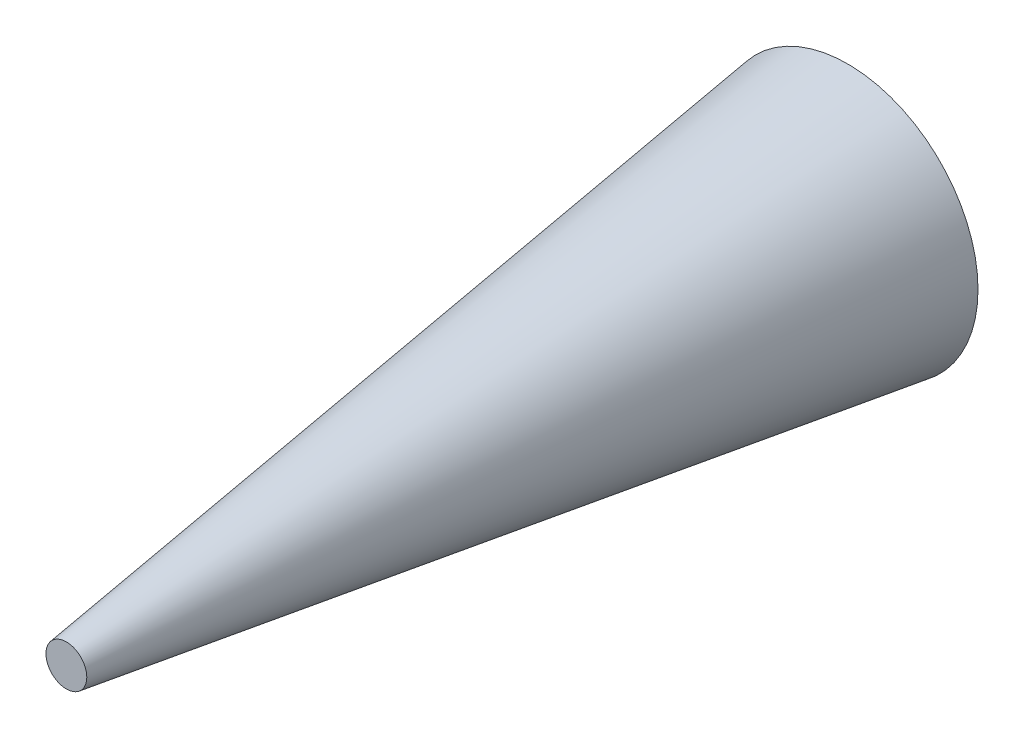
ISO-10303-21;
HEADER;
FILE_DESCRIPTION(('STEP AP214'),'2;1');
FILE_NAME('part.step','',(''),(''),'','','');
FILE_SCHEMA(('AUTOMOTIVE_DESIGN { 1 0 10303 214 1 1 1 1 }'));
ENDSEC;
DATA;
#1=APPLICATION_CONTEXT('core data for automotive mechanical design processes');
#2=APPLICATION_PROTOCOL_DEFINITION('international standard','automotive_design',2000,#1);
#3=PRODUCT_CONTEXT('',#1,'mechanical');
#4=PRODUCT('Part','Part','',(#3));
#5=PRODUCT_RELATED_PRODUCT_CATEGORY('part','',(#4));
#6=PRODUCT_DEFINITION_FORMATION('','',#4);
#7=PRODUCT_DEFINITION_CONTEXT('part definition',#1,'design');
#8=PRODUCT_DEFINITION('design','',#6,#7);
#9=PRODUCT_DEFINITION_SHAPE('','',#8);
#10=(LENGTH_UNIT() NAMED_UNIT(*) SI_UNIT(.MILLI.,.METRE.));
#11=(NAMED_UNIT(*) PLANE_ANGLE_UNIT() SI_UNIT($,.RADIAN.));
#12=(NAMED_UNIT(*) SI_UNIT($,.STERADIAN.) SOLID_ANGLE_UNIT());
#13=UNCERTAINTY_MEASURE_WITH_UNIT(LENGTH_MEASURE(1.E-05),#10,'distance_accuracy_value','');
#14=(GEOMETRIC_REPRESENTATION_CONTEXT(3) GLOBAL_UNCERTAINTY_ASSIGNED_CONTEXT((#13)) GLOBAL_UNIT_ASSIGNED_CONTEXT((#10,
#11,#12)) REPRESENTATION_CONTEXT('',''));
#15=CARTESIAN_POINT('',(0.,0.,0.));
#16=DIRECTION('',(0.,0.,1.));
#17=DIRECTION('',(1.,0.,0.));
#18=AXIS2_PLACEMENT_3D('',#15,#16,#17);
#19=CARTESIAN_POINT('',(0.,0.,0.));
#20=DIRECTION('',(0.,0.,-1.));
#21=DIRECTION('',(1.,0.,0.));
#22=AXIS2_PLACEMENT_3D('',#19,#20,#21);
#23=CONICAL_SURFACE('',#22,10.,0.139626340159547);
#24=CARTESIAN_POINT('',(0.,0.,60.));
#25=DIRECTION('',(0.,0.,1.));
#26=DIRECTION('',(1.,0.,0.));
#27=AXIS2_PLACEMENT_3D('',#24,#25,#26);
#28=CIRCLE('',#27,1.5675499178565);
#29=CARTESIAN_POINT('',(1.5675499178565,0.,60.));
#30=VERTEX_POINT('',#29);
#31=EDGE_CURVE('E10',#30,#30,#28,.T.);
#32=CARTESIAN_POINT('',(0.,0.,0.));
#33=DIRECTION('',(0.,0.,1.));
#34=DIRECTION('',(1.,0.,0.));
#35=AXIS2_PLACEMENT_3D('',#32,#33,#34);
#36=CIRCLE('',#35,10.);
#37=CARTESIAN_POINT('',(10.,0.,0.));
#38=VERTEX_POINT('',#37);
#39=EDGE_CURVE('E36',#38,#38,#36,.T.);
#40=CARTESIAN_POINT('',(1.5675499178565,0.,60.));
#41=CARTESIAN_POINT('',(1.65538793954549,0.,59.375));
#42=CARTESIAN_POINT('',(1.74322596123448,0.,58.75));
#43=CARTESIAN_POINT('',(1.91890200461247,0.,57.5));
#44=CARTESIAN_POINT('',(2.00674002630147,0.,56.875));
#45=CARTESIAN_POINT('',(2.18241606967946,0.,55.625));
#46=CARTESIAN_POINT('',(2.27025409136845,0.,55.));
#47=CARTESIAN_POINT('',(2.44593013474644,0.,53.75));
#48=CARTESIAN_POINT('',(2.53376815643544,0.,53.125));
#49=CARTESIAN_POINT('',(2.70944419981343,0.,51.875));
#50=CARTESIAN_POINT('',(2.79728222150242,0.,51.25));
#51=CARTESIAN_POINT('',(2.97295826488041,0.,50.));
#52=CARTESIAN_POINT('',(3.06079628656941,0.,49.375));
#53=CARTESIAN_POINT('',(3.2364723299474,0.,48.125));
#54=CARTESIAN_POINT('',(3.32431035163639,0.,47.5));
#55=CARTESIAN_POINT('',(3.49998639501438,0.,46.25));
#56=CARTESIAN_POINT('',(3.58782441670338,0.,45.625));
#57=CARTESIAN_POINT('',(3.76350046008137,0.,44.375));
#58=CARTESIAN_POINT('',(3.85133848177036,0.,43.75));
#59=CARTESIAN_POINT('',(4.02701452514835,0.,42.5));
#60=CARTESIAN_POINT('',(4.11485254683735,0.,41.875));
#61=CARTESIAN_POINT('',(4.29052859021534,0.,40.625));
#62=CARTESIAN_POINT('',(4.37836661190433,0.,40.));
#63=CARTESIAN_POINT('',(4.55404265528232,0.,38.75));
#64=CARTESIAN_POINT('',(4.64188067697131,0.,38.125));
#65=CARTESIAN_POINT('',(4.8175567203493,0.,36.875));
#66=CARTESIAN_POINT('',(4.9053947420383,0.,36.25));
#67=CARTESIAN_POINT('',(5.08107078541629,0.,35.));
#68=CARTESIAN_POINT('',(5.16890880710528,0.,34.375));
#69=CARTESIAN_POINT('',(5.34458485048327,0.,33.125));
#70=CARTESIAN_POINT('',(5.43242287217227,0.,32.5));
#71=CARTESIAN_POINT('',(5.60809891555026,0.,31.25));
#72=CARTESIAN_POINT('',(5.69593693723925,0.,30.625));
#73=CARTESIAN_POINT('',(5.87161298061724,0.,29.375));
#74=CARTESIAN_POINT('',(5.95945100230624,0.,28.75));
#75=CARTESIAN_POINT('',(6.13512704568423,0.,27.5));
#76=CARTESIAN_POINT('',(6.22296506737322,0.,26.875));
#77=CARTESIAN_POINT('',(6.39864111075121,0.,25.625));
#78=CARTESIAN_POINT('',(6.48647913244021,0.,25.));
#79=CARTESIAN_POINT('',(6.6621551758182,0.,23.75));
#80=CARTESIAN_POINT('',(6.74999319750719,0.,23.125));
#81=CARTESIAN_POINT('',(6.92566924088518,0.,21.875));
#82=CARTESIAN_POINT('',(7.01350726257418,0.,21.25));
#83=CARTESIAN_POINT('',(7.18918330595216,0.,20.));
#84=CARTESIAN_POINT('',(7.27702132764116,0.,19.375));
#85=CARTESIAN_POINT('',(7.45269737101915,0.,18.125));
#86=CARTESIAN_POINT('',(7.54053539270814,0.,17.5));
#87=CARTESIAN_POINT('',(7.71621143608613,0.,16.25));
#88=CARTESIAN_POINT('',(7.80404945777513,0.,15.625));
#89=CARTESIAN_POINT('',(7.97972550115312,0.,14.375));
#90=CARTESIAN_POINT('',(8.06756352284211,0.,13.75));
#91=CARTESIAN_POINT('',(8.2432395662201,0.,12.5));
#92=CARTESIAN_POINT('',(8.3310775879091,0.,11.875));
#93=CARTESIAN_POINT('',(8.50675363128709,0.,10.625));
#94=CARTESIAN_POINT('',(8.59459165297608,0.,10.));
#95=CARTESIAN_POINT('',(8.77026769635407,0.,8.75));
#96=CARTESIAN_POINT('',(8.85810571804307,0.,8.125));
#97=CARTESIAN_POINT('',(9.03378176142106,0.,6.875));
#98=CARTESIAN_POINT('',(9.12161978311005,0.,6.25));
#99=CARTESIAN_POINT('',(9.29729582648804,0.,5.));
#100=CARTESIAN_POINT('',(9.38513384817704,0.,4.375));
#101=CARTESIAN_POINT('',(9.56080989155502,0.,3.125));
#102=CARTESIAN_POINT('',(9.64864791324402,0.,2.5));
#103=CARTESIAN_POINT('',(9.82432395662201,0.,1.25));
#104=CARTESIAN_POINT('',(9.91216197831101,0.,0.625000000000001));
#105=CARTESIAN_POINT('',(10.,0.,0.));
#106=B_SPLINE_CURVE_WITH_KNOTS('',3,(#40,#41,#42,#43,#44,#45,#46,#47,#48,#49,#50,#51,#52,#53,
#54,#55,#56,#57,#58,#59,#60,#61,#62,#63,#64,#65,#66,#67,#68,#69,#70,#71,#72,#73,#74,#75,#76,#77,
#78,#79,#80,#81,#82,#83,#84,#85,#86,#87,#88,#89,#90,#91,#92,#93,#94,#95,#96,#97,#98,#99,#100,
#101,#102,#103,#104,#105),.UNSPECIFIED.,.F.,.F.,(4,2,2,2,2,2,2,2,2,2,2,2,2,2,2,2,2,2,2,2,2,2,2,
2,2,2,2,2,2,2,2,2,4),(0.,1.89342669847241,3.78685339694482,5.68028009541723,7.57370679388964,
9.46713349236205,11.3605601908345,13.2539868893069,15.1474135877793,17.0408402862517,
18.9342669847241,20.8276936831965,22.7211203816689,24.6145470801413,26.5079737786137,
28.4014004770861,30.2948271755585,32.188253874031,34.0816805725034,35.9751072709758,
37.8685339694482,39.7619606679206,41.655387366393,43.5488140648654,45.4422407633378,
47.3356674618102,49.2290941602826,51.122520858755,53.0159475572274,54.9093742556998,
56.8028009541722,58.6962276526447,60.5896543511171),.UNSPECIFIED.);
#107=EDGE_CURVE('BSEAM30',#30,#38,#106,.T.);
#108=ORIENTED_EDGE('',*,*,#31,.F.);
#109=ORIENTED_EDGE('',*,*,#39,.T.);
#110=ORIENTED_EDGE('',*,*,#107,.T.);
#111=ORIENTED_EDGE('',*,*,#107,.F.);
#112=EDGE_LOOP('',(#108,#110,#109,#111));
#113=FACE_BOUND('',#112,.T.);
#114=ADVANCED_FACE('F30',(#113),#23,.T.);
#115=CARTESIAN_POINT('',(0.,0.,60.));
#116=DIRECTION('',(0.,0.,1.));
#117=DIRECTION('',(1.,0.,0.));
#118=AXIS2_PLACEMENT_3D('',#115,#116,#117);
#119=PLANE('',#118);
#120=ORIENTED_EDGE('',*,*,#31,.T.);
#121=EDGE_LOOP('',(#120));
#122=FACE_BOUND('',#121,.T.);
#123=ADVANCED_FACE('F45',(#122),#119,.T.);
#124=CARTESIAN_POINT('',(0.,0.,0.));
#125=DIRECTION('',(0.,0.,1.));
#126=DIRECTION('',(1.,0.,0.));
#127=AXIS2_PLACEMENT_3D('',#124,#125,#126);
#128=PLANE('',#127);
#129=ORIENTED_EDGE('',*,*,#39,.F.);
#130=EDGE_LOOP('',(#129));
#131=FACE_BOUND('',#130,.T.);
#132=ADVANCED_FACE('F43',(#131),#128,.F.);
#133=CLOSED_SHELL('',(#114,#123,#132));
#134=MANIFOLD_SOLID_BREP('B2',#133);
#135=ADVANCED_BREP_SHAPE_REPRESENTATION('',(#18,#134),#14);
#136=SHAPE_DEFINITION_REPRESENTATION(#9,#135);
ENDSEC;
END-ISO-10303-21;
